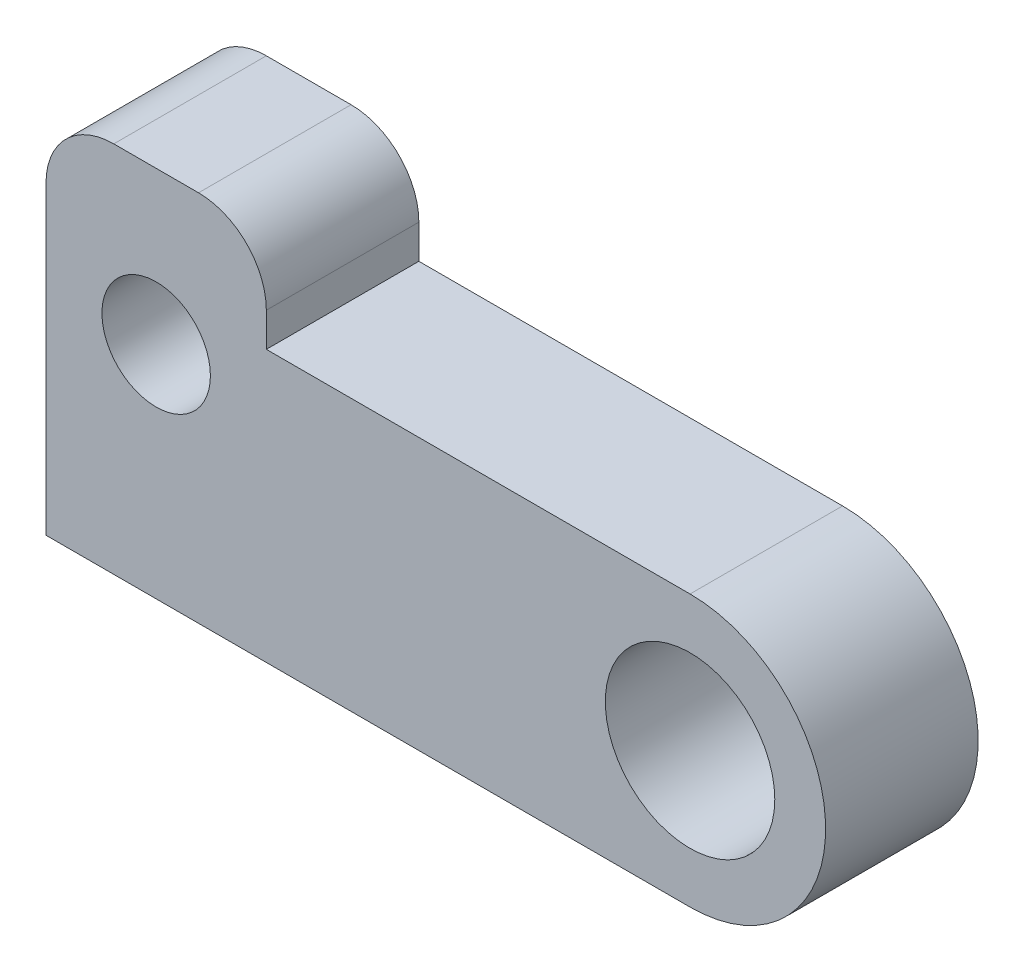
from build123d import *

# Parameters (mm, degrees)
CROQUIS1_R              = 2.5
CROQUIS1_R_2            = 1.6
SALIENTE_EXTRUIR1_DEPTH = 4.5


with BuildPart() as part:
    # Croquis1 → Saliente-Extruir1 (new body)
    with BuildSketch(Plane.XY):
        with BuildLine():
            Line((2, 0), (4.5, 0))
            ThreePointArc((4.5, 0), (5.914213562, -0.585786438), (6.5, -2))
            Line((6.5, -2), (6.5, -3))
            Line((6.5, -3), (19, -3))
            ThreePointArc((19, -3), (23, -7), (19, -11))
            Line((19, -11), (0, -11))
            Line((0, -11), (0, -2))
            ThreePointArc((0, -2), (0.585786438, -0.585786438), (2, 0))
        make_face()
        with Locations((19, -7)):
            Circle(CROQUIS1_R, mode=Mode.SUBTRACT)
        with Locations((3.25, -4.5)):
            Circle(CROQUIS1_R_2, mode=Mode.SUBTRACT)
    extrude(amount=SALIENTE_EXTRUIR1_DEPTH)


solid = part.part
